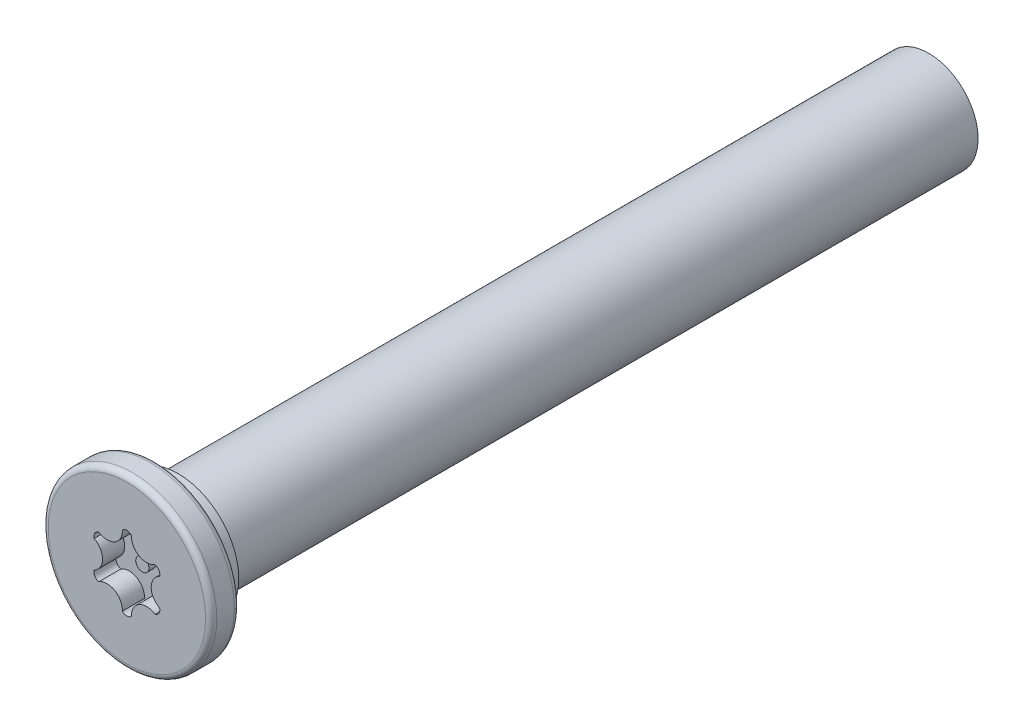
from build123d import *

# Parameters (mm, degrees)
SKETCH2_W           = 1.3
SKETCH2_H           = 3.81
SKETCH2_W_2         = 12.7
SKETCH2_H_2         = 2.23
CUT_EXTRUDE3_DEPTH  = 1
FILLET12_R          = 0.254
CUT_EXTRUDE6_START  = -12.7
SKETCH7_R           = 2.23
CUT_EXTRUDE6_DEPTH  = 12.7
SKETCH11_R          = 2.738000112
SKETCH11_R_2        = 2.230000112
BOSS_EXTRUDE1_DEPTH = 1.016
SKETCH12_R          = 2.230000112
BOSS_EXTRUDE2_DEPTH = 12.7
SKETCH14_R          = 0.3
BOSS_EXTRUDE4_DEPTH = 0.3
CUT_EXTRUDE7_START  = -12.7
SKETCH15_R          = 2.230000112
CUT_EXTRUDE7_DEPTH  = 12.7
SKETCH16_R          = 2.230000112
BOSS_EXTRUDE5_DEPTH = 34.925


with BuildPart() as part:
    # Sketch2 → Revolve1 (revolve)
    with BuildSketch(Plane(origin=(0, 0, 0), x_dir=(0, 0, -1), z_dir=(1, 0, 0)), mode=Mode.PRIVATE) as revolve1_sk:
        with Locations((0.65, 1.905)):
            Rectangle(SKETCH2_W, SKETCH2_H)
        with Locations((7.65, 1.115)):
            Rectangle(SKETCH2_W_2, SKETCH2_H_2)
    revolve(revolve1_sk.sketch.rotate(Axis((0, 0, -1.3), (0, 0, -1)), 90), axis=Axis((0, 0, -1.3), (0, 0, -1)))

    # Sketch3 → Cut-Extrude3 (cut)
    with BuildSketch(Plane.XY):
        with BuildLine():
            ThreePointArc((-0.205060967, 1.589373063), (0, 1.674312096), (0.205060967, 1.589373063))
            ThreePointArc((0.205060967, 1.589373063), (0.54882888, 0.950599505), (1.273906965, 0.972274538))
            ThreePointArc((1.273906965, 0.972274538), (1.449996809, 0.837156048), (1.478967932, 0.617098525))
            ThreePointArc((1.478967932, 0.617098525), (1.097657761, 0), (1.478967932, -0.617098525))
            ThreePointArc((1.478967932, -0.617098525), (1.449996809, -0.837156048), (1.273906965, -0.972274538))
            ThreePointArc((1.273906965, -0.972274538), (0.54882888, -0.950599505), (0.205060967, -1.589373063))
            ThreePointArc((0.205060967, -1.589373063), (0, -1.674312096), (-0.205060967, -1.589373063))
            ThreePointArc((-0.205060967, -1.589373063), (-0.54882888, -0.950599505), (-1.273906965, -0.972274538))
            ThreePointArc((-1.273906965, -0.972274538), (-1.449996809, -0.837156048), (-1.478967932, -0.617098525))
            ThreePointArc((-1.478967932, -0.617098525), (-1.097657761, 0), (-1.478967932, 0.617098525))
            ThreePointArc((-1.478967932, 0.617098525), (-1.449996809, 0.837156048), (-1.273906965, 0.972274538))
            ThreePointArc((-1.273906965, 0.972274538), (-0.54882888, 0.950599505), (-0.205060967, 1.589373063))
        make_face()
    extrude(amount=-CUT_EXTRUDE3_DEPTH, mode=Mode.SUBTRACT)

    # Fillet12
    fillet12_edges = [part.edges().sort_by_distance(p)[0] for p in [
        (-3.81, 0, 0),
        (-3.81, 0, -1.3),
    ]]
    fillet(fillet12_edges, radius=FILLET12_R)

    # Sketch7 → Cut-Extrude6 (cut)
    with BuildSketch(Plane(origin=(0, 0, -14), x_dir=(-1, 0, 0), z_dir=(0, 0, -1)).offset(CUT_EXTRUDE6_START)):
        Circle(SKETCH7_R)
    extrude(amount=CUT_EXTRUDE6_DEPTH, mode=Mode.SUBTRACT)

    # Sketch11 → Boss-Extrude1 (add)
    with BuildSketch(Plane(origin=(0, 0, -1.3), x_dir=(-1, 0, 0), z_dir=(0, 0, -1))):
        with Locations(Location((0, 0, 0), (0, 0, 180))):
            Circle(SKETCH11_R)
        Circle(SKETCH11_R_2, mode=Mode.SUBTRACT)
    extrude(amount=BOSS_EXTRUDE1_DEPTH)

    # Sketch12 → Boss-Extrude2 (add)
    with BuildSketch(Plane(origin=(0, 0, -1.3), x_dir=(-1, 0, 0), z_dir=(0, 0, -1))):
        Circle(SKETCH12_R)
    extrude(amount=BOSS_EXTRUDE2_DEPTH)

    # Sketch14 → Boss-Extrude4 (add)
    with BuildSketch(Plane.XY.offset(-1)):
        Circle(SKETCH14_R)
    extrude(amount=BOSS_EXTRUDE4_DEPTH)

    # Sketch15 → Cut-Extrude7 (cut)
    with BuildSketch(Plane(origin=(0, 0, -14), x_dir=(-1, 0, 0), z_dir=(0, 0, -1)).offset(CUT_EXTRUDE7_START)):
        Circle(SKETCH15_R)
    extrude(amount=CUT_EXTRUDE7_DEPTH, mode=Mode.SUBTRACT)

    # Sketch16 → Boss-Extrude5 (add)
    with BuildSketch(Plane(origin=(0, 0, -1.3), x_dir=(-1, 0, 0), z_dir=(0, 0, -1))):
        Circle(SKETCH16_R)
    extrude(amount=BOSS_EXTRUDE5_DEPTH)


solid = part.part
